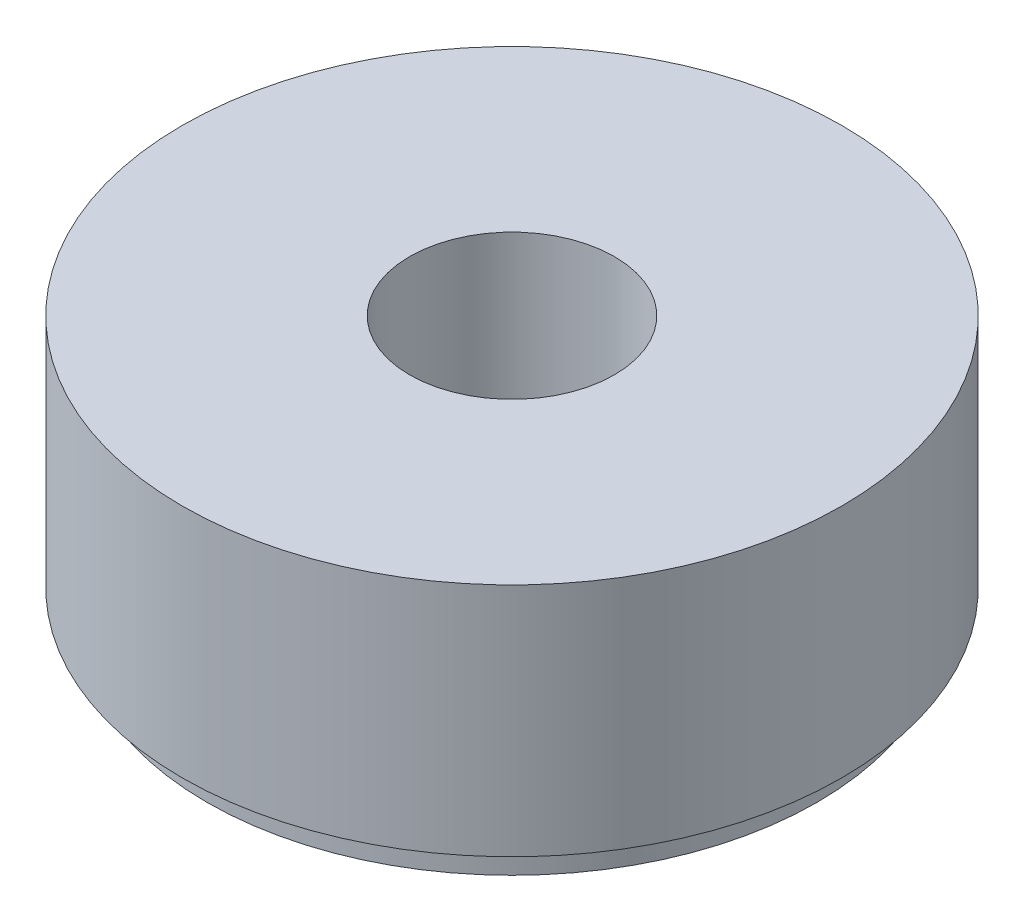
from build123d import *

# Parameters (mm, degrees)
SKETCH1_R           = 14.49
BOSS_EXTRUDE1_DEPTH = 2
SKETCH2_R           = 18.26
BOSS_EXTRUDE2_DEPTH = 2
SKETCH3_R           = 19.73
BOSS_EXTRUDE3_DEPTH = 14.09
CUT_EXTRUDE1_REACH  = 35.253
SKETCH4_R           = 6.13


with BuildPart() as part:
    # Sketch1 → Boss-Extrude1 (new body)
    with BuildSketch(Plane(origin=(0, 0, 0), x_dir=(1, 0, 0), z_dir=(0, 1, 0))):
        with Locations(Location((0, 0, 0), (0, 0, 270))):
            Circle(SKETCH1_R)
    extrude(amount=BOSS_EXTRUDE1_DEPTH)

    # Sketch2 → Boss-Extrude2 (add)
    with BuildSketch(Plane(origin=(0, 2, 0), x_dir=(1, 0, 0), z_dir=(0, 1, 0))):
        with Locations(Location((0, 0, 0), (0, 0, 270))):
            Circle(SKETCH2_R)
    extrude(amount=BOSS_EXTRUDE2_DEPTH)

    # Sketch3 → Boss-Extrude3 (add)
    with BuildSketch(Plane(origin=(0, 4, 0), x_dir=(1, 0, 0), z_dir=(0, 1, 0))):
        with Locations(Location((0, 0, 0), (0, 0, 270))):
            Circle(SKETCH3_R)
    extrude(amount=BOSS_EXTRUDE3_DEPTH)

    # Sketch4 → Cut-Extrude1 (cut, up to next)
    with BuildSketch(Plane.XZ, mode=Mode.PRIVATE) as cut_extrude1_sk1:
        with Locations(Location((0, 0, 0), (0, 0, 270))):
            Circle(SKETCH4_R)
    cut_extrude1_tool1 = extrude(cut_extrude1_sk1.sketch, amount=-CUT_EXTRUDE1_REACH, mode=Mode.PRIVATE) & part.part
    add(cut_extrude1_tool1.solids().sort_by_distance((0, 0, 0))[0], mode=Mode.SUBTRACT)


solid = part.part
